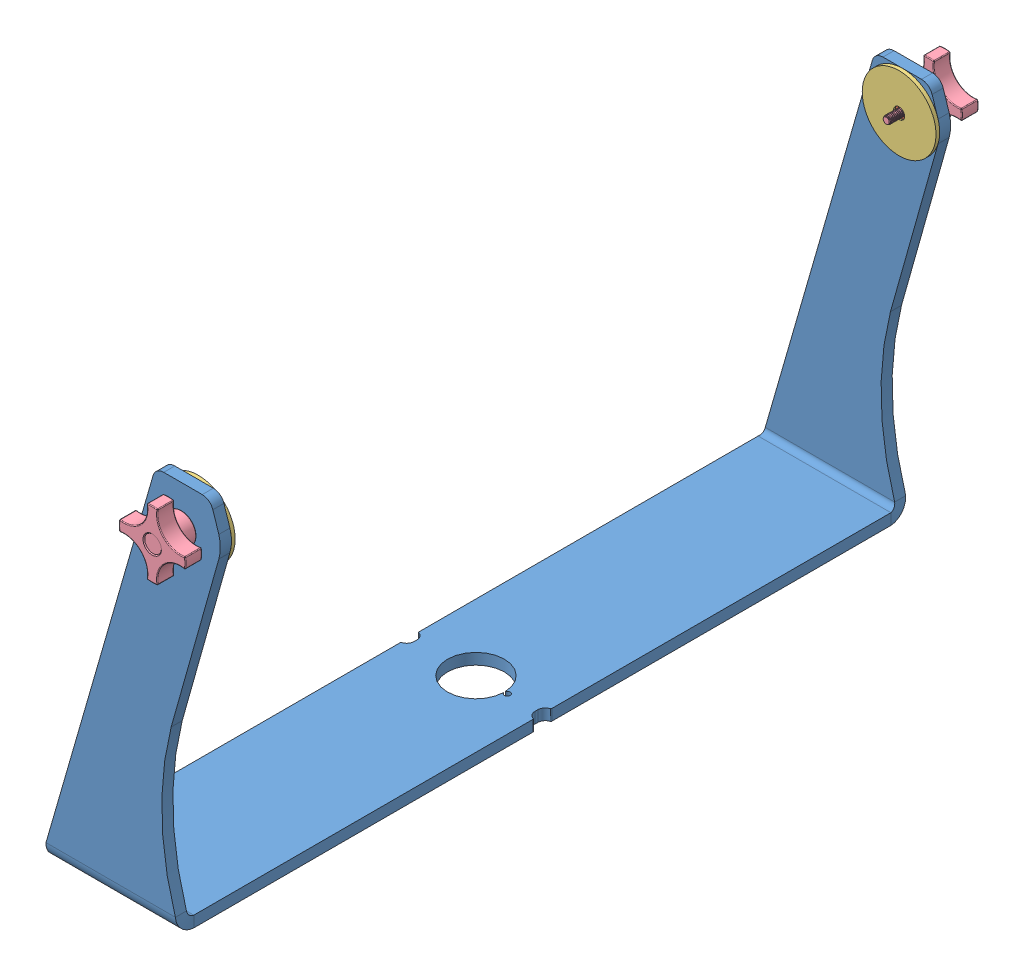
SolidWorks assembly All Yoke Configurations, YKxx.SLDASM, configuration YK23 (file format 13000). Lengths in mm.
Overall size (152.35 341.02 682.68).
7 component instances, 4 part files, 12 mates.
Components (placement in the parent):
- All Yoke Configurations, YKxx-1: All Yoke Configurations, YKxx.SLDPRT [YK23] at (-299.287 -297.794 -170.2657) x (0 0 1) z (-1 0 0) size (628.68 341.02 152.35)
- Bushing, 30500-1: Bushing, 30500.sldprt [Default] at (-236.6677 11.4764 -486.2036)
- Bushing, 30500-2: Bushing, 30500.sldprt [Default] at (-236.6677 11.4764 145.6722) x (0.925701 0.378255 0) z (0 0 -1)
- Rubber Washer, 10177-1: Rubber Washer, 10177.sldprt [Default] at (-416.2992 -180.577 -475.0784) x (-1 0 0) z (0 0 1)
- Rubber Washer, 10177-2: Rubber Washer, 10177.sldprt [Default] at (-416.2992 -180.577 131.372) x (-1 0 0) z (0 0 1)
- Knob, 30053-1: Knob, 30053.sldprt [Default] at (-236.6677 11.4764 132.9722)
- Knob, 30053-2: Knob, 30053.sldprt [Default] at (-236.6677 11.4764 -473.5036) x (-1 0 0) z (0 0 -1)
Mates (geometry in assembly coordinates):
- Concentric5: concentric anti-aligned: cylinder of All Yoke Configurations, YKxx-1 through (-236.6677 11.4764 -484.6034) axis (0 0 1) radius 4.9657; cylinder of Bushing, 30500-1 through (-236.6677 11.4764 -473.5036) axis (0 0 -1) radius 4.7625
- Coincident13: coincident anti-aligned: plane of All Yoke Configurations, YKxx-1 through (-1.4342 -207.1633 -484.6034) normal (0 0 -1); plane of Bushing, 30500-1 through (-236.1053 11.4764 -484.6034) normal (0 0 1)
- Concentric6: concentric aligned: cylinder of All Yoke Configurations, YKxx-1 through (-236.6677 11.4764 -484.6034) axis (0 0 1) radius 4.9657; cylinder of Bushing, 30500-2 through (-236.6677 11.4764 132.9722) axis (0 0 1) radius 4.7625
- Coincident14: coincident anti-aligned: plane of All Yoke Configurations, YKxx-1 through (-1.4342 -207.1633 144.072) normal (0 0 1); plane of Bushing, 30500-2 through (-236.1471 11.6891 144.072) normal (0 0 -1)
- Coincident15: coincident anti-aligned: plane of All Yoke Configurations, YKxx-1 through (-1.4342 -207.1633 -475.0784) normal (0 0 1); plane of Rubber Washer, 10177-1 through (-239.2341 11.4764 -475.0784) normal (0 0 -1)
- Concentric7: concentric aligned: cylinder of All Yoke Configurations, YKxx-1 through (-236.6677 11.4764 -484.6034) axis (0 0 1) radius 4.9657; cylinder of Rubber Washer, 10177-1 through (-236.6677 11.4764 -475.0784) axis (0 0 1) radius 4.7625
- Coincident16: coincident anti-aligned: plane of All Yoke Configurations, YKxx-1 through (-1.4342 -207.1633 134.547) normal (0 0 -1); plane of Rubber Washer, 10177-2 through (-239.2341 11.4764 134.547) normal (0 0 1)
- Concentric8: concentric aligned: cylinder of All Yoke Configurations, YKxx-1 through (-236.6677 11.4764 -484.6034) axis (0 0 1) radius 4.9657; cylinder of Rubber Washer, 10177-2 through (-236.6677 11.4764 131.372) axis (0 0 1) radius 4.7625
- Coincident17: coincident anti-aligned: plane of Bushing, 30500-2 through (-236.1695 11.68 145.6722) normal (0 0 1); plane of Knob, 30053-1 through (-236.6677 11.4764 145.6722) normal (0 0 -1)
- Concentric9: concentric anti-aligned: cylinder of All Yoke Configurations, YKxx-1 through (-236.6677 11.4764 -484.6034) axis (0 0 1) radius 4.9657; circle of Knob, 30053-1
- Coincident18: coincident anti-aligned: plane of Bushing, 30500-1 through (-236.1295 11.4764 -486.2036) normal (0 0 -1); plane of Knob, 30053-2 through (-236.6677 11.4764 -486.2036) normal (0 0 1)
- Concentric10: concentric aligned: cylinder of All Yoke Configurations, YKxx-1 through (-236.6677 11.4764 -484.6034) axis (0 0 1) radius 4.9657; circle of Knob, 30053-2
